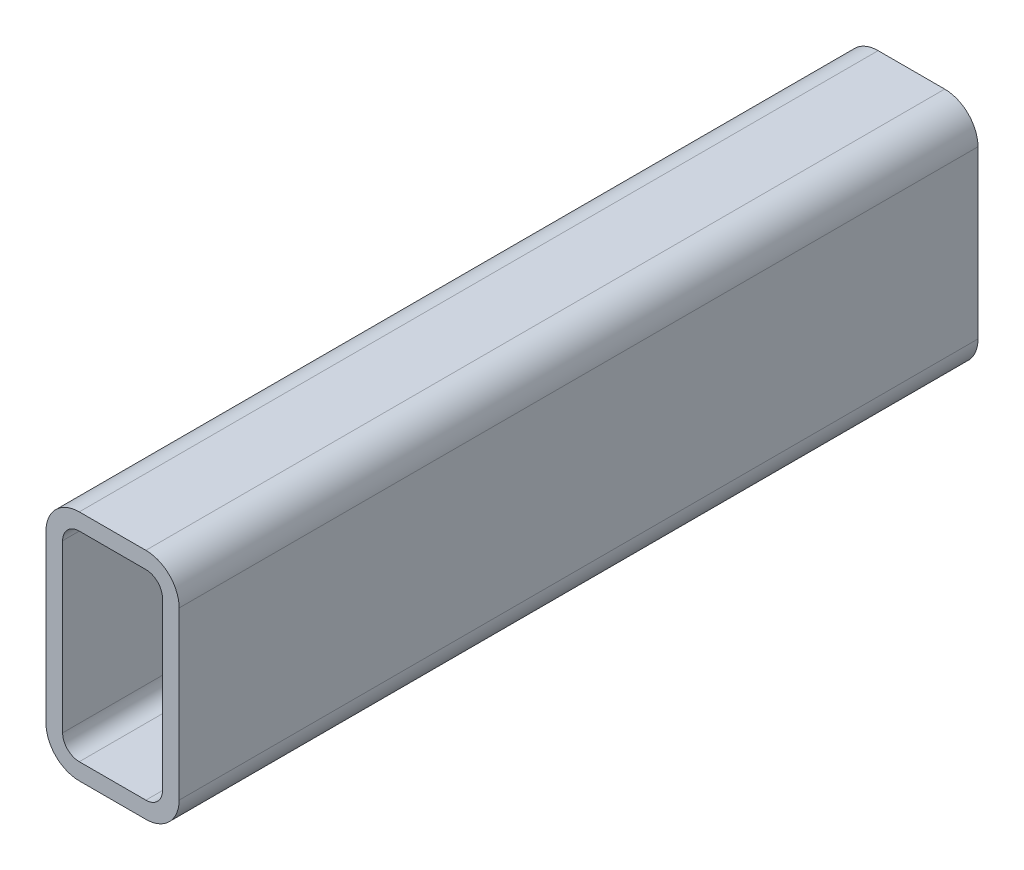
ISO-10303-21;
HEADER;
FILE_DESCRIPTION(('STEP AP214'),'2;1');
FILE_NAME('part.step','',(''),(''),'','','');
FILE_SCHEMA(('AUTOMOTIVE_DESIGN { 1 0 10303 214 1 1 1 1 }'));
ENDSEC;
DATA;
#1=APPLICATION_CONTEXT('core data for automotive mechanical design processes');
#2=APPLICATION_PROTOCOL_DEFINITION('international standard','automotive_design',2000,#1);
#3=PRODUCT_CONTEXT('',#1,'mechanical');
#4=PRODUCT('Part','Part','',(#3));
#5=PRODUCT_RELATED_PRODUCT_CATEGORY('part','',(#4));
#6=PRODUCT_DEFINITION_FORMATION('','',#4);
#7=PRODUCT_DEFINITION_CONTEXT('part definition',#1,'design');
#8=PRODUCT_DEFINITION('design','',#6,#7);
#9=PRODUCT_DEFINITION_SHAPE('','',#8);
#10=(LENGTH_UNIT() NAMED_UNIT(*) SI_UNIT(.MILLI.,.METRE.));
#11=(NAMED_UNIT(*) PLANE_ANGLE_UNIT() SI_UNIT($,.RADIAN.));
#12=(NAMED_UNIT(*) SI_UNIT($,.STERADIAN.) SOLID_ANGLE_UNIT());
#13=UNCERTAINTY_MEASURE_WITH_UNIT(LENGTH_MEASURE(1.E-05),#10,'distance_accuracy_value','');
#14=(GEOMETRIC_REPRESENTATION_CONTEXT(3) GLOBAL_UNCERTAINTY_ASSIGNED_CONTEXT((#13)) GLOBAL_UNIT_ASSIGNED_CONTEXT((#10,
#11,#12)) REPRESENTATION_CONTEXT('',''));
#15=CARTESIAN_POINT('',(0.,0.,0.));
#16=DIRECTION('',(0.,0.,1.));
#17=DIRECTION('',(1.,0.,0.));
#18=AXIS2_PLACEMENT_3D('',#15,#16,#17);
#19=CARTESIAN_POINT('',(12.7,76.2,304.8));
#20=DIRECTION('',(0.,0.,1.));
#21=DIRECTION('',(1.,0.,0.));
#22=AXIS2_PLACEMENT_3D('',#19,#20,#21);
#23=PLANE('',#22);
#24=CARTESIAN_POINT('',(12.7,76.2,304.8));
#25=DIRECTION('',(0.,0.,1.));
#26=DIRECTION('',(1.,0.,0.));
#27=AXIS2_PLACEMENT_3D('',#24,#25,#26);
#28=CIRCLE('',#27,12.7);
#29=CARTESIAN_POINT('',(12.7,88.9,304.8));
#30=VERTEX_POINT('',#29);
#31=CARTESIAN_POINT('',(0.,76.2,304.8));
#32=VERTEX_POINT('',#31);
#33=EDGE_CURVE('E211',#30,#32,#28,.T.);
#34=ORIENTED_EDGE('',*,*,#33,.T.);
#35=DIRECTION('',(0.,-1.,0.));
#36=VECTOR('',#35,1.);
#37=CARTESIAN_POINT('',(0.,12.7,304.8));
#38=LINE('',#37,#36);
#39=CARTESIAN_POINT('',(0.,12.7,304.8));
#40=VERTEX_POINT('',#39);
#41=EDGE_CURVE('E214',#32,#40,#38,.T.);
#42=ORIENTED_EDGE('',*,*,#41,.T.);
#43=CARTESIAN_POINT('',(12.7,12.7,304.8));
#44=DIRECTION('',(0.,0.,1.));
#45=DIRECTION('',(1.,0.,0.));
#46=AXIS2_PLACEMENT_3D('',#43,#44,#45);
#47=CIRCLE('',#46,12.7);
#48=CARTESIAN_POINT('',(12.7,0.,304.8));
#49=VERTEX_POINT('',#48);
#50=EDGE_CURVE('E217',#40,#49,#47,.T.);
#51=ORIENTED_EDGE('',*,*,#50,.T.);
#52=DIRECTION('',(1.,0.,0.));
#53=VECTOR('',#52,1.);
#54=CARTESIAN_POINT('',(38.1,0.,304.8));
#55=LINE('',#54,#53);
#56=CARTESIAN_POINT('',(38.1,0.,304.8));
#57=VERTEX_POINT('',#56);
#58=EDGE_CURVE('E219',#49,#57,#55,.T.);
#59=ORIENTED_EDGE('',*,*,#58,.T.);
#60=CARTESIAN_POINT('',(38.1,12.7,304.8));
#61=DIRECTION('',(0.,0.,1.));
#62=DIRECTION('',(1.,0.,0.));
#63=AXIS2_PLACEMENT_3D('',#60,#61,#62);
#64=CIRCLE('',#63,12.7);
#65=CARTESIAN_POINT('',(50.8,12.7,304.8));
#66=VERTEX_POINT('',#65);
#67=EDGE_CURVE('E221',#57,#66,#64,.T.);
#68=ORIENTED_EDGE('',*,*,#67,.T.);
#69=DIRECTION('',(0.,1.,0.));
#70=VECTOR('',#69,1.);
#71=CARTESIAN_POINT('',(50.8,76.2,304.8));
#72=LINE('',#71,#70);
#73=CARTESIAN_POINT('',(50.8,76.2,304.8));
#74=VERTEX_POINT('',#73);
#75=EDGE_CURVE('E223',#66,#74,#72,.T.);
#76=ORIENTED_EDGE('',*,*,#75,.T.);
#77=CARTESIAN_POINT('',(38.1,76.2,304.8));
#78=DIRECTION('',(0.,0.,1.));
#79=DIRECTION('',(1.,0.,0.));
#80=AXIS2_PLACEMENT_3D('',#77,#78,#79);
#81=CIRCLE('',#80,12.7);
#82=CARTESIAN_POINT('',(38.1,88.9,304.8));
#83=VERTEX_POINT('',#82);
#84=EDGE_CURVE('E225',#74,#83,#81,.T.);
#85=ORIENTED_EDGE('',*,*,#84,.T.);
#86=DIRECTION('',(-1.,0.,0.));
#87=VECTOR('',#86,1.);
#88=CARTESIAN_POINT('',(12.7,88.9,304.8));
#89=LINE('',#88,#87);
#90=EDGE_CURVE('E227',#83,#30,#89,.T.);
#91=ORIENTED_EDGE('',*,*,#90,.T.);
#92=EDGE_LOOP('',(#34,#42,#51,#59,#68,#76,#85,#91));
#93=FACE_BOUND('',#92,.T.);
#94=DIRECTION('',(0.,-1.,0.));
#95=VECTOR('',#94,1.);
#96=CARTESIAN_POINT('',(6.35,12.7,304.8));
#97=LINE('',#96,#95);
#98=CARTESIAN_POINT('',(6.35,76.2,304.8));
#99=VERTEX_POINT('',#98);
#100=CARTESIAN_POINT('',(6.35,12.7,304.8));
#101=VERTEX_POINT('',#100);
#102=EDGE_CURVE('E154',#99,#101,#97,.T.);
#103=ORIENTED_EDGE('',*,*,#102,.F.);
#104=CARTESIAN_POINT('',(12.7,76.2,304.8));
#105=DIRECTION('',(0.,0.,1.));
#106=DIRECTION('',(1.,0.,0.));
#107=AXIS2_PLACEMENT_3D('',#104,#105,#106);
#108=CIRCLE('',#107,6.35);
#109=CARTESIAN_POINT('',(12.7,82.55,304.8));
#110=VERTEX_POINT('',#109);
#111=EDGE_CURVE('E146',#110,#99,#108,.T.);
#112=ORIENTED_EDGE('',*,*,#111,.F.);
#113=DIRECTION('',(-1.,0.,0.));
#114=VECTOR('',#113,1.);
#115=CARTESIAN_POINT('',(12.7,82.55,304.8));
#116=LINE('',#115,#114);
#117=CARTESIAN_POINT('',(38.1,82.55,304.8));
#118=VERTEX_POINT('',#117);
#119=EDGE_CURVE('E179',#118,#110,#116,.T.);
#120=ORIENTED_EDGE('',*,*,#119,.F.);
#121=CARTESIAN_POINT('',(38.1,76.2,304.8));
#122=DIRECTION('',(0.,0.,1.));
#123=DIRECTION('',(1.,0.,0.));
#124=AXIS2_PLACEMENT_3D('',#121,#122,#123);
#125=CIRCLE('',#124,6.35);
#126=CARTESIAN_POINT('',(44.45,76.2,304.8));
#127=VERTEX_POINT('',#126);
#128=EDGE_CURVE('E177',#127,#118,#125,.T.);
#129=ORIENTED_EDGE('',*,*,#128,.F.);
#130=DIRECTION('',(0.,1.,0.));
#131=VECTOR('',#130,1.);
#132=CARTESIAN_POINT('',(44.45,76.2,304.8));
#133=LINE('',#132,#131);
#134=CARTESIAN_POINT('',(44.45,12.7,304.8));
#135=VERTEX_POINT('',#134);
#136=EDGE_CURVE('E175',#135,#127,#133,.T.);
#137=ORIENTED_EDGE('',*,*,#136,.F.);
#138=CARTESIAN_POINT('',(38.1,12.7,304.8));
#139=DIRECTION('',(0.,0.,1.));
#140=DIRECTION('',(1.,0.,0.));
#141=AXIS2_PLACEMENT_3D('',#138,#139,#140);
#142=CIRCLE('',#141,6.35);
#143=CARTESIAN_POINT('',(38.1,6.35000000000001,304.8));
#144=VERTEX_POINT('',#143);
#145=EDGE_CURVE('E173',#144,#135,#142,.T.);
#146=ORIENTED_EDGE('',*,*,#145,.F.);
#147=DIRECTION('',(1.,0.,0.));
#148=VECTOR('',#147,1.);
#149=CARTESIAN_POINT('',(38.1,6.35000000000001,304.8));
#150=LINE('',#149,#148);
#151=CARTESIAN_POINT('',(12.7,6.35000000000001,304.8));
#152=VERTEX_POINT('',#151);
#153=EDGE_CURVE('E169',#152,#144,#150,.T.);
#154=ORIENTED_EDGE('',*,*,#153,.F.);
#155=CARTESIAN_POINT('',(12.7,12.7,304.8));
#156=DIRECTION('',(0.,0.,1.));
#157=DIRECTION('',(1.,0.,0.));
#158=AXIS2_PLACEMENT_3D('',#155,#156,#157);
#159=CIRCLE('',#158,6.35);
#160=EDGE_CURVE('E167',#101,#152,#159,.T.);
#161=ORIENTED_EDGE('',*,*,#160,.F.);
#162=EDGE_LOOP('',(#103,#112,#120,#129,#137,#146,#154,#161));
#163=FACE_BOUND('',#162,.T.);
#164=ADVANCED_FACE('F33',(#93,#163),#23,.T.);
#165=CARTESIAN_POINT('',(12.7,76.2,0.));
#166=DIRECTION('',(0.,0.,1.));
#167=DIRECTION('',(1.,0.,0.));
#168=AXIS2_PLACEMENT_3D('',#165,#166,#167);
#169=PLANE('',#168);
#170=CARTESIAN_POINT('',(12.7,76.2,0.));
#171=DIRECTION('',(0.,0.,1.));
#172=DIRECTION('',(1.,0.,0.));
#173=AXIS2_PLACEMENT_3D('',#170,#171,#172);
#174=CIRCLE('',#173,12.7);
#175=CARTESIAN_POINT('',(12.7,88.9,0.));
#176=VERTEX_POINT('',#175);
#177=CARTESIAN_POINT('',(0.,76.2,0.));
#178=VERTEX_POINT('',#177);
#179=EDGE_CURVE('E162',#176,#178,#174,.T.);
#180=ORIENTED_EDGE('',*,*,#179,.F.);
#181=DIRECTION('',(-1.,0.,0.));
#182=VECTOR('',#181,1.);
#183=CARTESIAN_POINT('',(12.7,88.9,0.));
#184=LINE('',#183,#182);
#185=CARTESIAN_POINT('',(38.1,88.9,0.));
#186=VERTEX_POINT('',#185);
#187=EDGE_CURVE('E215',#186,#176,#184,.T.);
#188=ORIENTED_EDGE('',*,*,#187,.F.);
#189=CARTESIAN_POINT('',(38.1,76.2,0.));
#190=DIRECTION('',(0.,0.,1.));
#191=DIRECTION('',(1.,0.,0.));
#192=AXIS2_PLACEMENT_3D('',#189,#190,#191);
#193=CIRCLE('',#192,12.7);
#194=CARTESIAN_POINT('',(50.8,76.2,0.));
#195=VERTEX_POINT('',#194);
#196=EDGE_CURVE('E242',#195,#186,#193,.T.);
#197=ORIENTED_EDGE('',*,*,#196,.F.);
#198=DIRECTION('',(0.,1.,0.));
#199=VECTOR('',#198,1.);
#200=CARTESIAN_POINT('',(50.8,76.2,0.));
#201=LINE('',#200,#199);
#202=CARTESIAN_POINT('',(50.8,12.7,0.));
#203=VERTEX_POINT('',#202);
#204=EDGE_CURVE('E240',#203,#195,#201,.T.);
#205=ORIENTED_EDGE('',*,*,#204,.F.);
#206=CARTESIAN_POINT('',(38.1,12.7,0.));
#207=DIRECTION('',(0.,0.,1.));
#208=DIRECTION('',(1.,0.,0.));
#209=AXIS2_PLACEMENT_3D('',#206,#207,#208);
#210=CIRCLE('',#209,12.7);
#211=CARTESIAN_POINT('',(38.1,0.,0.));
#212=VERTEX_POINT('',#211);
#213=EDGE_CURVE('E238',#212,#203,#210,.T.);
#214=ORIENTED_EDGE('',*,*,#213,.F.);
#215=DIRECTION('',(1.,0.,0.));
#216=VECTOR('',#215,1.);
#217=CARTESIAN_POINT('',(38.1,0.,0.));
#218=LINE('',#217,#216);
#219=CARTESIAN_POINT('',(12.7,0.,0.));
#220=VERTEX_POINT('',#219);
#221=EDGE_CURVE('E236',#220,#212,#218,.T.);
#222=ORIENTED_EDGE('',*,*,#221,.F.);
#223=CARTESIAN_POINT('',(12.7,12.7,0.));
#224=DIRECTION('',(0.,0.,1.));
#225=DIRECTION('',(1.,0.,0.));
#226=AXIS2_PLACEMENT_3D('',#223,#224,#225);
#227=CIRCLE('',#226,12.7);
#228=CARTESIAN_POINT('',(0.,12.7,0.));
#229=VERTEX_POINT('',#228);
#230=EDGE_CURVE('E234',#229,#220,#227,.T.);
#231=ORIENTED_EDGE('',*,*,#230,.F.);
#232=DIRECTION('',(0.,-1.,0.));
#233=VECTOR('',#232,1.);
#234=CARTESIAN_POINT('',(0.,12.7,0.));
#235=LINE('',#234,#233);
#236=EDGE_CURVE('E232',#178,#229,#235,.T.);
#237=ORIENTED_EDGE('',*,*,#236,.F.);
#238=EDGE_LOOP('',(#180,#188,#197,#205,#214,#222,#231,#237));
#239=FACE_BOUND('',#238,.T.);
#240=CARTESIAN_POINT('',(12.7,76.2,0.));
#241=DIRECTION('',(0.,0.,1.));
#242=DIRECTION('',(1.,0.,0.));
#243=AXIS2_PLACEMENT_3D('',#240,#241,#242);
#244=CIRCLE('',#243,6.35);
#245=CARTESIAN_POINT('',(12.7,82.55,0.));
#246=VERTEX_POINT('',#245);
#247=CARTESIAN_POINT('',(6.35,76.2,0.));
#248=VERTEX_POINT('',#247);
#249=EDGE_CURVE('E56',#246,#248,#244,.T.);
#250=ORIENTED_EDGE('',*,*,#249,.T.);
#251=DIRECTION('',(0.,-1.,0.));
#252=VECTOR('',#251,1.);
#253=CARTESIAN_POINT('',(6.35,12.7,0.));
#254=LINE('',#253,#252);
#255=CARTESIAN_POINT('',(6.35,12.7,0.));
#256=VERTEX_POINT('',#255);
#257=EDGE_CURVE('E161',#248,#256,#254,.T.);
#258=ORIENTED_EDGE('',*,*,#257,.T.);
#259=CARTESIAN_POINT('',(12.7,12.7,0.));
#260=DIRECTION('',(0.,0.,1.));
#261=DIRECTION('',(1.,0.,0.));
#262=AXIS2_PLACEMENT_3D('',#259,#260,#261);
#263=CIRCLE('',#262,6.35);
#264=CARTESIAN_POINT('',(12.7,6.35000000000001,0.));
#265=VERTEX_POINT('',#264);
#266=EDGE_CURVE('E183',#256,#265,#263,.T.);
#267=ORIENTED_EDGE('',*,*,#266,.T.);
#268=DIRECTION('',(1.,0.,0.));
#269=VECTOR('',#268,1.);
#270=CARTESIAN_POINT('',(38.1,6.35000000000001,0.));
#271=LINE('',#270,#269);
#272=CARTESIAN_POINT('',(38.1,6.35000000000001,0.));
#273=VERTEX_POINT('',#272);
#274=EDGE_CURVE('E186',#265,#273,#271,.T.);
#275=ORIENTED_EDGE('',*,*,#274,.T.);
#276=CARTESIAN_POINT('',(38.1,12.7,0.));
#277=DIRECTION('',(0.,0.,1.));
#278=DIRECTION('',(1.,0.,0.));
#279=AXIS2_PLACEMENT_3D('',#276,#277,#278);
#280=CIRCLE('',#279,6.35);
#281=CARTESIAN_POINT('',(44.45,12.7,0.));
#282=VERTEX_POINT('',#281);
#283=EDGE_CURVE('E189',#273,#282,#280,.T.);
#284=ORIENTED_EDGE('',*,*,#283,.T.);
#285=DIRECTION('',(0.,1.,0.));
#286=VECTOR('',#285,1.);
#287=CARTESIAN_POINT('',(44.45,76.2,0.));
#288=LINE('',#287,#286);
#289=CARTESIAN_POINT('',(44.45,76.2,0.));
#290=VERTEX_POINT('',#289);
#291=EDGE_CURVE('E192',#282,#290,#288,.T.);
#292=ORIENTED_EDGE('',*,*,#291,.T.);
#293=CARTESIAN_POINT('',(38.1,76.2,0.));
#294=DIRECTION('',(0.,0.,1.));
#295=DIRECTION('',(1.,0.,0.));
#296=AXIS2_PLACEMENT_3D('',#293,#294,#295);
#297=CIRCLE('',#296,6.35);
#298=CARTESIAN_POINT('',(38.1,82.55,0.));
#299=VERTEX_POINT('',#298);
#300=EDGE_CURVE('E195',#290,#299,#297,.T.);
#301=ORIENTED_EDGE('',*,*,#300,.T.);
#302=DIRECTION('',(-1.,0.,0.));
#303=VECTOR('',#302,1.);
#304=CARTESIAN_POINT('',(12.7,82.55,0.));
#305=LINE('',#304,#303);
#306=EDGE_CURVE('E155',#299,#246,#305,.T.);
#307=ORIENTED_EDGE('',*,*,#306,.T.);
#308=EDGE_LOOP('',(#250,#258,#267,#275,#284,#292,#301,#307));
#309=FACE_BOUND('',#308,.T.);
#310=ADVANCED_FACE('F272',(#239,#309),#169,.F.);
#311=CARTESIAN_POINT('',(12.7,76.2,304.8));
#312=DIRECTION('',(0.,0.,-1.));
#313=DIRECTION('',(-1.,0.,0.));
#314=AXIS2_PLACEMENT_3D('',#311,#312,#313);
#315=CYLINDRICAL_SURFACE('',#314,12.7);
#316=ORIENTED_EDGE('',*,*,#179,.T.);
#317=DIRECTION('',(0.,0.,-1.));
#318=VECTOR('',#317,1.);
#319=CARTESIAN_POINT('',(0.,76.2,304.8));
#320=LINE('',#319,#318);
#321=EDGE_CURVE('E11',#32,#178,#320,.T.);
#322=ORIENTED_EDGE('',*,*,#321,.F.);
#323=ORIENTED_EDGE('',*,*,#33,.F.);
#324=DIRECTION('',(0.,0.,-1.));
#325=VECTOR('',#324,1.);
#326=CARTESIAN_POINT('',(12.7,88.9,304.8));
#327=LINE('',#326,#325);
#328=EDGE_CURVE('E229',#30,#176,#327,.T.);
#329=ORIENTED_EDGE('',*,*,#328,.T.);
#330=EDGE_LOOP('',(#316,#322,#323,#329));
#331=FACE_BOUND('',#330,.T.);
#332=ADVANCED_FACE('F35',(#331),#315,.T.);
#333=CARTESIAN_POINT('',(0.,12.7,304.8));
#334=DIRECTION('',(1.,0.,0.));
#335=DIRECTION('',(0.,0.,-1.));
#336=AXIS2_PLACEMENT_3D('',#333,#334,#335);
#337=PLANE('',#336);
#338=ORIENTED_EDGE('',*,*,#236,.T.);
#339=DIRECTION('',(0.,0.,-1.));
#340=VECTOR('',#339,1.);
#341=CARTESIAN_POINT('',(0.,12.7,304.8));
#342=LINE('',#341,#340);
#343=EDGE_CURVE('E41',#40,#229,#342,.T.);
#344=ORIENTED_EDGE('',*,*,#343,.F.);
#345=ORIENTED_EDGE('',*,*,#41,.F.);
#346=ORIENTED_EDGE('',*,*,#321,.T.);
#347=EDGE_LOOP('',(#338,#344,#345,#346));
#348=FACE_BOUND('',#347,.T.);
#349=ADVANCED_FACE('F289',(#348),#337,.F.);
#350=CARTESIAN_POINT('',(12.7,12.7,304.8));
#351=DIRECTION('',(0.,0.,-1.));
#352=DIRECTION('',(-1.,0.,0.));
#353=AXIS2_PLACEMENT_3D('',#350,#351,#352);
#354=CYLINDRICAL_SURFACE('',#353,12.7);
#355=ORIENTED_EDGE('',*,*,#230,.T.);
#356=DIRECTION('',(0.,0.,-1.));
#357=VECTOR('',#356,1.);
#358=CARTESIAN_POINT('',(12.7,0.,304.8));
#359=LINE('',#358,#357);
#360=EDGE_CURVE('E259',#49,#220,#359,.T.);
#361=ORIENTED_EDGE('',*,*,#360,.F.);
#362=ORIENTED_EDGE('',*,*,#50,.F.);
#363=ORIENTED_EDGE('',*,*,#343,.T.);
#364=EDGE_LOOP('',(#355,#361,#362,#363));
#365=FACE_BOUND('',#364,.T.);
#366=ADVANCED_FACE('F266',(#365),#354,.T.);
#367=CARTESIAN_POINT('',(38.1,0.,304.8));
#368=DIRECTION('',(0.,1.,0.));
#369=DIRECTION('',(0.,0.,1.));
#370=AXIS2_PLACEMENT_3D('',#367,#368,#369);
#371=PLANE('',#370);
#372=ORIENTED_EDGE('',*,*,#221,.T.);
#373=DIRECTION('',(0.,0.,-1.));
#374=VECTOR('',#373,1.);
#375=CARTESIAN_POINT('',(38.1,0.,304.8));
#376=LINE('',#375,#374);
#377=EDGE_CURVE('E256',#57,#212,#376,.T.);
#378=ORIENTED_EDGE('',*,*,#377,.F.);
#379=ORIENTED_EDGE('',*,*,#58,.F.);
#380=ORIENTED_EDGE('',*,*,#360,.T.);
#381=EDGE_LOOP('',(#372,#378,#379,#380));
#382=FACE_BOUND('',#381,.T.);
#383=ADVANCED_FACE('F278',(#382),#371,.F.);
#384=CARTESIAN_POINT('',(38.1,12.7,304.8));
#385=DIRECTION('',(0.,0.,-1.));
#386=DIRECTION('',(-1.,0.,0.));
#387=AXIS2_PLACEMENT_3D('',#384,#385,#386);
#388=CYLINDRICAL_SURFACE('',#387,12.7);
#389=ORIENTED_EDGE('',*,*,#213,.T.);
#390=DIRECTION('',(0.,0.,-1.));
#391=VECTOR('',#390,1.);
#392=CARTESIAN_POINT('',(50.8,12.7,304.8));
#393=LINE('',#392,#391);
#394=EDGE_CURVE('E253',#66,#203,#393,.T.);
#395=ORIENTED_EDGE('',*,*,#394,.F.);
#396=ORIENTED_EDGE('',*,*,#67,.F.);
#397=ORIENTED_EDGE('',*,*,#377,.T.);
#398=EDGE_LOOP('',(#389,#395,#396,#397));
#399=FACE_BOUND('',#398,.T.);
#400=ADVANCED_FACE('F282',(#399),#388,.T.);
#401=CARTESIAN_POINT('',(50.8,76.2,304.8));
#402=DIRECTION('',(-1.,0.,0.));
#403=DIRECTION('',(0.,0.,1.));
#404=AXIS2_PLACEMENT_3D('',#401,#402,#403);
#405=PLANE('',#404);
#406=ORIENTED_EDGE('',*,*,#204,.T.);
#407=DIRECTION('',(0.,0.,-1.));
#408=VECTOR('',#407,1.);
#409=CARTESIAN_POINT('',(50.8,76.2,304.8));
#410=LINE('',#409,#408);
#411=EDGE_CURVE('E250',#74,#195,#410,.T.);
#412=ORIENTED_EDGE('',*,*,#411,.F.);
#413=ORIENTED_EDGE('',*,*,#75,.F.);
#414=ORIENTED_EDGE('',*,*,#394,.T.);
#415=EDGE_LOOP('',(#406,#412,#413,#414));
#416=FACE_BOUND('',#415,.T.);
#417=ADVANCED_FACE('F302',(#416),#405,.F.);
#418=CARTESIAN_POINT('',(38.1,76.2,304.8));
#419=DIRECTION('',(0.,0.,-1.));
#420=DIRECTION('',(-1.,0.,0.));
#421=AXIS2_PLACEMENT_3D('',#418,#419,#420);
#422=CYLINDRICAL_SURFACE('',#421,12.7);
#423=ORIENTED_EDGE('',*,*,#196,.T.);
#424=DIRECTION('',(0.,0.,-1.));
#425=VECTOR('',#424,1.);
#426=CARTESIAN_POINT('',(38.1,88.9,304.8));
#427=LINE('',#426,#425);
#428=EDGE_CURVE('E247',#83,#186,#427,.T.);
#429=ORIENTED_EDGE('',*,*,#428,.F.);
#430=ORIENTED_EDGE('',*,*,#84,.F.);
#431=ORIENTED_EDGE('',*,*,#411,.T.);
#432=EDGE_LOOP('',(#423,#429,#430,#431));
#433=FACE_BOUND('',#432,.T.);
#434=ADVANCED_FACE('F300',(#433),#422,.T.);
#435=CARTESIAN_POINT('',(12.7,88.9,304.8));
#436=DIRECTION('',(0.,-1.,0.));
#437=DIRECTION('',(0.,0.,-1.));
#438=AXIS2_PLACEMENT_3D('',#435,#436,#437);
#439=PLANE('',#438);
#440=ORIENTED_EDGE('',*,*,#187,.T.);
#441=ORIENTED_EDGE('',*,*,#328,.F.);
#442=ORIENTED_EDGE('',*,*,#90,.F.);
#443=ORIENTED_EDGE('',*,*,#428,.T.);
#444=EDGE_LOOP('',(#440,#441,#442,#443));
#445=FACE_BOUND('',#444,.T.);
#446=ADVANCED_FACE('F295',(#445),#439,.F.);
#447=CARTESIAN_POINT('',(12.7,76.2,304.8));
#448=DIRECTION('',(0.,0.,-1.));
#449=DIRECTION('',(-1.,0.,0.));
#450=AXIS2_PLACEMENT_3D('',#447,#448,#449);
#451=CYLINDRICAL_SURFACE('',#450,6.35);
#452=ORIENTED_EDGE('',*,*,#249,.F.);
#453=DIRECTION('',(0.,0.,-1.));
#454=VECTOR('',#453,1.);
#455=CARTESIAN_POINT('',(12.7,82.55,304.8));
#456=LINE('',#455,#454);
#457=EDGE_CURVE('E150',#110,#246,#456,.T.);
#458=ORIENTED_EDGE('',*,*,#457,.F.);
#459=ORIENTED_EDGE('',*,*,#111,.T.);
#460=DIRECTION('',(0.,0.,-1.));
#461=VECTOR('',#460,1.);
#462=CARTESIAN_POINT('',(6.35,76.2,304.8));
#463=LINE('',#462,#461);
#464=EDGE_CURVE('E149',#99,#248,#463,.T.);
#465=ORIENTED_EDGE('',*,*,#464,.T.);
#466=EDGE_LOOP('',(#452,#458,#459,#465));
#467=FACE_BOUND('',#466,.T.);
#468=ADVANCED_FACE('F148',(#467),#451,.F.);
#469=CARTESIAN_POINT('',(6.35,12.7,304.8));
#470=DIRECTION('',(1.,0.,0.));
#471=DIRECTION('',(0.,0.,-1.));
#472=AXIS2_PLACEMENT_3D('',#469,#470,#471);
#473=PLANE('',#472);
#474=ORIENTED_EDGE('',*,*,#257,.F.);
#475=ORIENTED_EDGE('',*,*,#464,.F.);
#476=ORIENTED_EDGE('',*,*,#102,.T.);
#477=DIRECTION('',(0.,0.,-1.));
#478=VECTOR('',#477,1.);
#479=CARTESIAN_POINT('',(6.35,12.7,304.8));
#480=LINE('',#479,#478);
#481=EDGE_CURVE('E163',#101,#256,#480,.T.);
#482=ORIENTED_EDGE('',*,*,#481,.T.);
#483=EDGE_LOOP('',(#474,#475,#476,#482));
#484=FACE_BOUND('',#483,.T.);
#485=ADVANCED_FACE('F158',(#484),#473,.T.);
#486=CARTESIAN_POINT('',(12.7,12.7,304.8));
#487=DIRECTION('',(0.,0.,-1.));
#488=DIRECTION('',(-1.,0.,0.));
#489=AXIS2_PLACEMENT_3D('',#486,#487,#488);
#490=CYLINDRICAL_SURFACE('',#489,6.35);
#491=ORIENTED_EDGE('',*,*,#266,.F.);
#492=ORIENTED_EDGE('',*,*,#481,.F.);
#493=ORIENTED_EDGE('',*,*,#160,.T.);
#494=DIRECTION('',(0.,0.,-1.));
#495=VECTOR('',#494,1.);
#496=CARTESIAN_POINT('',(12.7,6.35000000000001,304.8));
#497=LINE('',#496,#495);
#498=EDGE_CURVE('E208',#152,#265,#497,.T.);
#499=ORIENTED_EDGE('',*,*,#498,.T.);
#500=EDGE_LOOP('',(#491,#492,#493,#499));
#501=FACE_BOUND('',#500,.T.);
#502=ADVANCED_FACE('F327',(#501),#490,.F.);
#503=CARTESIAN_POINT('',(38.1,6.35000000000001,304.8));
#504=DIRECTION('',(0.,1.,0.));
#505=DIRECTION('',(0.,0.,1.));
#506=AXIS2_PLACEMENT_3D('',#503,#504,#505);
#507=PLANE('',#506);
#508=ORIENTED_EDGE('',*,*,#274,.F.);
#509=ORIENTED_EDGE('',*,*,#498,.F.);
#510=ORIENTED_EDGE('',*,*,#153,.T.);
#511=DIRECTION('',(0.,0.,-1.));
#512=VECTOR('',#511,1.);
#513=CARTESIAN_POINT('',(38.1,6.35000000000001,304.8));
#514=LINE('',#513,#512);
#515=EDGE_CURVE('E206',#144,#273,#514,.T.);
#516=ORIENTED_EDGE('',*,*,#515,.T.);
#517=EDGE_LOOP('',(#508,#509,#510,#516));
#518=FACE_BOUND('',#517,.T.);
#519=ADVANCED_FACE('F331',(#518),#507,.T.);
#520=CARTESIAN_POINT('',(38.1,12.7,304.8));
#521=DIRECTION('',(0.,0.,-1.));
#522=DIRECTION('',(-1.,0.,0.));
#523=AXIS2_PLACEMENT_3D('',#520,#521,#522);
#524=CYLINDRICAL_SURFACE('',#523,6.35);
#525=ORIENTED_EDGE('',*,*,#283,.F.);
#526=ORIENTED_EDGE('',*,*,#515,.F.);
#527=ORIENTED_EDGE('',*,*,#145,.T.);
#528=DIRECTION('',(0.,0.,-1.));
#529=VECTOR('',#528,1.);
#530=CARTESIAN_POINT('',(44.45,12.7,304.8));
#531=LINE('',#530,#529);
#532=EDGE_CURVE('E204',#135,#282,#531,.T.);
#533=ORIENTED_EDGE('',*,*,#532,.T.);
#534=EDGE_LOOP('',(#525,#526,#527,#533));
#535=FACE_BOUND('',#534,.T.);
#536=ADVANCED_FACE('F337',(#535),#524,.F.);
#537=CARTESIAN_POINT('',(44.45,76.2,304.8));
#538=DIRECTION('',(-1.,0.,0.));
#539=DIRECTION('',(0.,0.,1.));
#540=AXIS2_PLACEMENT_3D('',#537,#538,#539);
#541=PLANE('',#540);
#542=ORIENTED_EDGE('',*,*,#291,.F.);
#543=ORIENTED_EDGE('',*,*,#532,.F.);
#544=ORIENTED_EDGE('',*,*,#136,.T.);
#545=DIRECTION('',(0.,0.,-1.));
#546=VECTOR('',#545,1.);
#547=CARTESIAN_POINT('',(44.45,76.2,304.8));
#548=LINE('',#547,#546);
#549=EDGE_CURVE('E202',#127,#290,#548,.T.);
#550=ORIENTED_EDGE('',*,*,#549,.T.);
#551=EDGE_LOOP('',(#542,#543,#544,#550));
#552=FACE_BOUND('',#551,.T.);
#553=ADVANCED_FACE('F341',(#552),#541,.T.);
#554=CARTESIAN_POINT('',(38.1,76.2,304.8));
#555=DIRECTION('',(0.,0.,-1.));
#556=DIRECTION('',(-1.,0.,0.));
#557=AXIS2_PLACEMENT_3D('',#554,#555,#556);
#558=CYLINDRICAL_SURFACE('',#557,6.35);
#559=ORIENTED_EDGE('',*,*,#300,.F.);
#560=ORIENTED_EDGE('',*,*,#549,.F.);
#561=ORIENTED_EDGE('',*,*,#128,.T.);
#562=DIRECTION('',(0.,0.,-1.));
#563=VECTOR('',#562,1.);
#564=CARTESIAN_POINT('',(38.1,82.55,304.8));
#565=LINE('',#564,#563);
#566=EDGE_CURVE('E48',#118,#299,#565,.T.);
#567=ORIENTED_EDGE('',*,*,#566,.T.);
#568=EDGE_LOOP('',(#559,#560,#561,#567));
#569=FACE_BOUND('',#568,.T.);
#570=ADVANCED_FACE('F345',(#569),#558,.F.);
#571=CARTESIAN_POINT('',(12.7,82.55,304.8));
#572=DIRECTION('',(0.,-1.,0.));
#573=DIRECTION('',(0.,0.,-1.));
#574=AXIS2_PLACEMENT_3D('',#571,#572,#573);
#575=PLANE('',#574);
#576=ORIENTED_EDGE('',*,*,#306,.F.);
#577=ORIENTED_EDGE('',*,*,#566,.F.);
#578=ORIENTED_EDGE('',*,*,#119,.T.);
#579=ORIENTED_EDGE('',*,*,#457,.T.);
#580=EDGE_LOOP('',(#576,#577,#578,#579));
#581=FACE_BOUND('',#580,.T.);
#582=ADVANCED_FACE('F349',(#581),#575,.T.);
#583=CLOSED_SHELL('',(#164,#310,#332,#349,#366,#383,#400,#417,#434,#446,#468,#485,#502,#519,
#536,#553,#570,#582));
#584=MANIFOLD_SOLID_BREP('B2',#583);
#585=ADVANCED_BREP_SHAPE_REPRESENTATION('',(#18,#584),#14);
#586=SHAPE_DEFINITION_REPRESENTATION(#9,#585);
ENDSEC;
END-ISO-10303-21;
